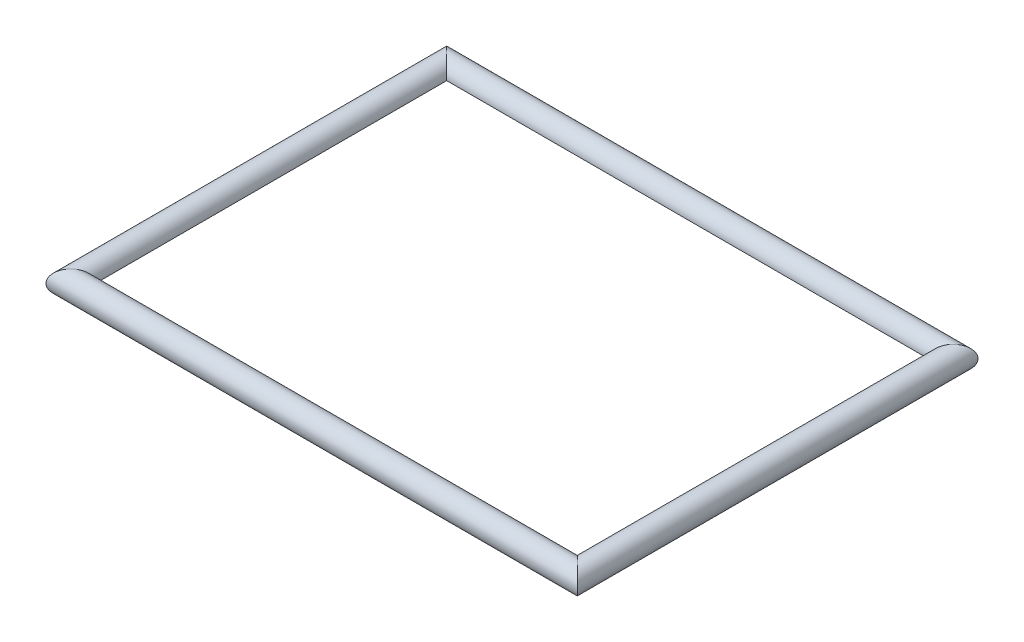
ISO-10303-21;
HEADER;
FILE_DESCRIPTION(('STEP AP214'),'2;1');
FILE_NAME('part.step','',(''),(''),'','','');
FILE_SCHEMA(('AUTOMOTIVE_DESIGN { 1 0 10303 214 1 1 1 1 }'));
ENDSEC;
DATA;
#1=APPLICATION_CONTEXT('core data for automotive mechanical design processes');
#2=APPLICATION_PROTOCOL_DEFINITION('international standard','automotive_design',2000,#1);
#3=PRODUCT_CONTEXT('',#1,'mechanical');
#4=PRODUCT('Part','Part','',(#3));
#5=PRODUCT_RELATED_PRODUCT_CATEGORY('part','',(#4));
#6=PRODUCT_DEFINITION_FORMATION('','',#4);
#7=PRODUCT_DEFINITION_CONTEXT('part definition',#1,'design');
#8=PRODUCT_DEFINITION('design','',#6,#7);
#9=PRODUCT_DEFINITION_SHAPE('','',#8);
#10=(LENGTH_UNIT() NAMED_UNIT(*) SI_UNIT(.MILLI.,.METRE.));
#11=(NAMED_UNIT(*) PLANE_ANGLE_UNIT() SI_UNIT($,.RADIAN.));
#12=(NAMED_UNIT(*) SI_UNIT($,.STERADIAN.) SOLID_ANGLE_UNIT());
#13=UNCERTAINTY_MEASURE_WITH_UNIT(LENGTH_MEASURE(1.E-05),#10,'distance_accuracy_value','');
#14=(GEOMETRIC_REPRESENTATION_CONTEXT(3) GLOBAL_UNCERTAINTY_ASSIGNED_CONTEXT((#13)) GLOBAL_UNIT_ASSIGNED_CONTEXT((#10,
#11,#12)) REPRESENTATION_CONTEXT('',''));
#15=CARTESIAN_POINT('',(0.,0.,0.));
#16=DIRECTION('',(0.,0.,1.));
#17=DIRECTION('',(1.,0.,0.));
#18=AXIS2_PLACEMENT_3D('',#15,#16,#17);
#19=CARTESIAN_POINT('',(107.4,0.,-75.55));
#20=DIRECTION('',(-1.,0.,0.));
#21=DIRECTION('',(0.,0.,1.));
#22=AXIS2_PLACEMENT_3D('',#19,#20,#21);
#23=CYLINDRICAL_SURFACE('',#22,5.);
#24=DIRECTION('',(-1.,0.,0.));
#25=VECTOR('',#24,1.);
#26=CARTESIAN_POINT('',(107.4,-5.,-75.55));
#27=LINE('',#26,#25);
#28=CARTESIAN_POINT('',(101.8,-5.,-75.55));
#29=VERTEX_POINT('',#28);
#30=CARTESIAN_POINT('',(-101.8,-5.,-75.55));
#31=VERTEX_POINT('',#30);
#32=EDGE_CURVE('E138',#29,#31,#27,.T.);
#33=ORIENTED_EDGE('',*,*,#32,.T.);
#34=CARTESIAN_POINT('',(-101.8,0.,-75.5500000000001));
#35=DIRECTION('',(-0.707106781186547,0.,0.707106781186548));
#36=DIRECTION('',(0.707106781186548,0.,0.707106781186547));
#37=AXIS2_PLACEMENT_3D('',#34,#35,#36);
#38=ELLIPSE('',#37,7.07106781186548,5.);
#39=CARTESIAN_POINT('',(-96.8,0.,-70.55));
#40=VERTEX_POINT('',#39);
#41=EDGE_CURVE('E60',#31,#40,#38,.F.);
#42=ORIENTED_EDGE('',*,*,#41,.T.);
#43=DIRECTION('',(-1.,0.,0.));
#44=VECTOR('',#43,1.);
#45=CARTESIAN_POINT('',(107.4,0.,-70.55));
#46=LINE('',#45,#44);
#47=CARTESIAN_POINT('',(96.8,0.,-70.55));
#48=VERTEX_POINT('',#47);
#49=EDGE_CURVE('E148',#40,#48,#46,.F.);
#50=ORIENTED_EDGE('',*,*,#49,.T.);
#51=CARTESIAN_POINT('',(101.8,0.,-75.55));
#52=DIRECTION('',(-0.707106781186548,0.,-0.707106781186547));
#53=DIRECTION('',(0.707106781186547,0.,-0.707106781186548));
#54=AXIS2_PLACEMENT_3D('',#51,#52,#53);
#55=ELLIPSE('',#54,7.07106781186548,5.);
#56=EDGE_CURVE('E143',#29,#48,#55,.F.);
#57=ORIENTED_EDGE('',*,*,#56,.F.);
#58=EDGE_LOOP('',(#33,#42,#50,#57));
#59=FACE_BOUND('',#58,.T.);
#60=ADVANCED_FACE('F57',(#59),#23,.T.);
#61=CARTESIAN_POINT('',(-101.8,0.,-81.1500000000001));
#62=DIRECTION('',(0.,0.,1.));
#63=DIRECTION('',(1.,0.,0.));
#64=AXIS2_PLACEMENT_3D('',#61,#62,#63);
#65=CYLINDRICAL_SURFACE('',#64,5.);
#66=DIRECTION('',(0.,0.,1.));
#67=VECTOR('',#66,1.);
#68=CARTESIAN_POINT('',(-101.8,-5.,-81.1500000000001));
#69=LINE('',#68,#67);
#70=CARTESIAN_POINT('',(-101.8,-5.,75.5500000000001));
#71=VERTEX_POINT('',#70);
#72=EDGE_CURVE('E124',#31,#71,#69,.T.);
#73=ORIENTED_EDGE('',*,*,#72,.T.);
#74=CARTESIAN_POINT('',(-101.8,0.,75.55));
#75=DIRECTION('',(0.707106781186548,0.,0.707106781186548));
#76=DIRECTION('',(0.707106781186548,0.,-0.707106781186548));
#77=AXIS2_PLACEMENT_3D('',#74,#75,#76);
#78=ELLIPSE('',#77,7.07106781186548,5.);
#79=CARTESIAN_POINT('',(-96.7999999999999,0.,70.55));
#80=VERTEX_POINT('',#79);
#81=EDGE_CURVE('E66',#71,#80,#78,.F.);
#82=ORIENTED_EDGE('',*,*,#81,.T.);
#83=DIRECTION('',(0.,0.,1.));
#84=VECTOR('',#83,1.);
#85=CARTESIAN_POINT('',(-96.8,0.,-81.1500000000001));
#86=LINE('',#85,#84);
#87=EDGE_CURVE('E82',#80,#40,#86,.F.);
#88=ORIENTED_EDGE('',*,*,#87,.T.);
#89=ORIENTED_EDGE('',*,*,#41,.F.);
#90=EDGE_LOOP('',(#73,#82,#88,#89));
#91=FACE_BOUND('',#90,.T.);
#92=ADVANCED_FACE('F135',(#91),#65,.T.);
#93=CARTESIAN_POINT('',(101.8,0.,81.15));
#94=DIRECTION('',(0.,0.,-1.));
#95=DIRECTION('',(-1.,0.,0.));
#96=AXIS2_PLACEMENT_3D('',#93,#94,#95);
#97=CYLINDRICAL_SURFACE('',#96,5.);
#98=DIRECTION('',(0.,0.,-1.));
#99=VECTOR('',#98,1.);
#100=CARTESIAN_POINT('',(101.8,-5.,81.15));
#101=LINE('',#100,#99);
#102=CARTESIAN_POINT('',(101.8,-5.,75.55));
#103=VERTEX_POINT('',#102);
#104=EDGE_CURVE('E119',#103,#29,#101,.T.);
#105=ORIENTED_EDGE('',*,*,#104,.T.);
#106=ORIENTED_EDGE('',*,*,#56,.T.);
#107=DIRECTION('',(0.,0.,-1.));
#108=VECTOR('',#107,1.);
#109=CARTESIAN_POINT('',(96.8000000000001,0.,81.15));
#110=LINE('',#109,#108);
#111=CARTESIAN_POINT('',(96.8,0.,70.55));
#112=VERTEX_POINT('',#111);
#113=EDGE_CURVE('E154',#48,#112,#110,.F.);
#114=ORIENTED_EDGE('',*,*,#113,.T.);
#115=CARTESIAN_POINT('',(101.8,0.,75.55));
#116=DIRECTION('',(0.707106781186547,0.,-0.707106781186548));
#117=DIRECTION('',(0.707106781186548,0.,0.707106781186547));
#118=AXIS2_PLACEMENT_3D('',#115,#116,#117);
#119=ELLIPSE('',#118,7.07106781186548,5.);
#120=EDGE_CURVE('E12',#103,#112,#119,.F.);
#121=ORIENTED_EDGE('',*,*,#120,.F.);
#122=EDGE_LOOP('',(#105,#106,#114,#121));
#123=FACE_BOUND('',#122,.T.);
#124=ADVANCED_FACE('F187',(#123),#97,.T.);
#125=CARTESIAN_POINT('',(-107.4,0.,75.55));
#126=DIRECTION('',(1.,0.,0.));
#127=DIRECTION('',(0.,0.,-1.));
#128=AXIS2_PLACEMENT_3D('',#125,#126,#127);
#129=CYLINDRICAL_SURFACE('',#128,5.);
#130=DIRECTION('',(1.,0.,0.));
#131=VECTOR('',#130,1.);
#132=CARTESIAN_POINT('',(-107.4,-5.,75.55));
#133=LINE('',#132,#131);
#134=EDGE_CURVE('E110',#71,#103,#133,.T.);
#135=ORIENTED_EDGE('',*,*,#134,.T.);
#136=ORIENTED_EDGE('',*,*,#120,.T.);
#137=DIRECTION('',(1.,0.,0.));
#138=VECTOR('',#137,1.);
#139=CARTESIAN_POINT('',(-107.4,0.,70.55));
#140=LINE('',#139,#138);
#141=EDGE_CURVE('E141',#112,#80,#140,.F.);
#142=ORIENTED_EDGE('',*,*,#141,.T.);
#143=ORIENTED_EDGE('',*,*,#81,.F.);
#144=EDGE_LOOP('',(#135,#136,#142,#143));
#145=FACE_BOUND('',#144,.T.);
#146=ADVANCED_FACE('F140',(#145),#129,.T.);
#147=CARTESIAN_POINT('',(101.8,-5.001,-75.55));
#148=DIRECTION('',(1.,0.,0.));
#149=DIRECTION('',(0.,0.,-1.));
#150=AXIS2_PLACEMENT_3D('',#147,#148,#149);
#151=PLANE('',#150);
#152=DIRECTION('',(0.,1.,0.));
#153=VECTOR('',#152,1.);
#154=CARTESIAN_POINT('',(101.8,-5.001,75.55));
#155=LINE('',#154,#153);
#156=CARTESIAN_POINT('',(101.8,0.,75.55));
#157=VERTEX_POINT('',#156);
#158=EDGE_CURVE('E74',#103,#157,#155,.T.);
#159=ORIENTED_EDGE('',*,*,#158,.T.);
#160=DIRECTION('',(0.,0.,-1.));
#161=VECTOR('',#160,1.);
#162=CARTESIAN_POINT('',(101.8,0.,-75.55));
#163=LINE('',#162,#161);
#164=CARTESIAN_POINT('',(101.8,0.,-75.55));
#165=VERTEX_POINT('',#164);
#166=EDGE_CURVE('E176',#157,#165,#163,.T.);
#167=ORIENTED_EDGE('',*,*,#166,.T.);
#168=DIRECTION('',(0.,1.,0.));
#169=VECTOR('',#168,1.);
#170=CARTESIAN_POINT('',(101.8,-5.001,-75.55));
#171=LINE('',#170,#169);
#172=EDGE_CURVE('E160',#29,#165,#171,.T.);
#173=ORIENTED_EDGE('',*,*,#172,.F.);
#174=ORIENTED_EDGE('',*,*,#104,.F.);
#175=EDGE_LOOP('',(#159,#167,#173,#174));
#176=FACE_BOUND('',#175,.T.);
#177=ADVANCED_FACE('F197',(#176),#151,.F.);
#178=CARTESIAN_POINT('',(-101.8,-5.001,-75.55));
#179=DIRECTION('',(-1.,0.,0.));
#180=DIRECTION('',(0.,0.,1.));
#181=AXIS2_PLACEMENT_3D('',#178,#179,#180);
#182=PLANE('',#181);
#183=DIRECTION('',(0.,1.,0.));
#184=VECTOR('',#183,1.);
#185=CARTESIAN_POINT('',(-101.8,-5.001,-75.55));
#186=LINE('',#185,#184);
#187=CARTESIAN_POINT('',(-101.8,0.,-75.55));
#188=VERTEX_POINT('',#187);
#189=EDGE_CURVE('E130',#31,#188,#186,.T.);
#190=ORIENTED_EDGE('',*,*,#189,.T.);
#191=DIRECTION('',(0.,0.,1.));
#192=VECTOR('',#191,1.);
#193=CARTESIAN_POINT('',(-101.8,0.,-75.55));
#194=LINE('',#193,#192);
#195=CARTESIAN_POINT('',(-101.8,0.,75.55));
#196=VERTEX_POINT('',#195);
#197=EDGE_CURVE('E127',#188,#196,#194,.T.);
#198=ORIENTED_EDGE('',*,*,#197,.T.);
#199=DIRECTION('',(0.,1.,0.));
#200=VECTOR('',#199,1.);
#201=CARTESIAN_POINT('',(-101.8,-5.001,75.55));
#202=LINE('',#201,#200);
#203=EDGE_CURVE('E113',#71,#196,#202,.T.);
#204=ORIENTED_EDGE('',*,*,#203,.F.);
#205=ORIENTED_EDGE('',*,*,#72,.F.);
#206=EDGE_LOOP('',(#190,#198,#204,#205));
#207=FACE_BOUND('',#206,.T.);
#208=ADVANCED_FACE('F123',(#207),#182,.F.);
#209=CARTESIAN_POINT('',(-101.8,-5.001,-75.55));
#210=DIRECTION('',(0.,0.,-1.));
#211=DIRECTION('',(-1.,0.,0.));
#212=AXIS2_PLACEMENT_3D('',#209,#210,#211);
#213=PLANE('',#212);
#214=ORIENTED_EDGE('',*,*,#172,.T.);
#215=DIRECTION('',(-1.,0.,0.));
#216=VECTOR('',#215,1.);
#217=CARTESIAN_POINT('',(-101.8,0.,-75.55));
#218=LINE('',#217,#216);
#219=EDGE_CURVE('E172',#165,#188,#218,.T.);
#220=ORIENTED_EDGE('',*,*,#219,.T.);
#221=ORIENTED_EDGE('',*,*,#189,.F.);
#222=ORIENTED_EDGE('',*,*,#32,.F.);
#223=EDGE_LOOP('',(#214,#220,#221,#222));
#224=FACE_BOUND('',#223,.T.);
#225=ADVANCED_FACE('F199',(#224),#213,.F.);
#226=CARTESIAN_POINT('',(-101.8,-5.001,75.55));
#227=DIRECTION('',(0.,0.,1.));
#228=DIRECTION('',(1.,0.,0.));
#229=AXIS2_PLACEMENT_3D('',#226,#227,#228);
#230=PLANE('',#229);
#231=ORIENTED_EDGE('',*,*,#203,.T.);
#232=DIRECTION('',(1.,0.,0.));
#233=VECTOR('',#232,1.);
#234=CARTESIAN_POINT('',(-101.8,0.,75.55));
#235=LINE('',#234,#233);
#236=EDGE_CURVE('E163',#196,#157,#235,.T.);
#237=ORIENTED_EDGE('',*,*,#236,.T.);
#238=ORIENTED_EDGE('',*,*,#158,.F.);
#239=ORIENTED_EDGE('',*,*,#134,.F.);
#240=EDGE_LOOP('',(#231,#237,#238,#239));
#241=FACE_BOUND('',#240,.T.);
#242=ADVANCED_FACE('F112',(#241),#230,.F.);
#243=CARTESIAN_POINT('',(0.,0.,0.));
#244=DIRECTION('',(0.,1.,0.));
#245=DIRECTION('',(0.,0.,1.));
#246=AXIS2_PLACEMENT_3D('',#243,#244,#245);
#247=PLANE('',#246);
#248=ORIENTED_EDGE('',*,*,#87,.F.);
#249=ORIENTED_EDGE('',*,*,#141,.F.);
#250=ORIENTED_EDGE('',*,*,#113,.F.);
#251=ORIENTED_EDGE('',*,*,#49,.F.);
#252=EDGE_LOOP('',(#248,#249,#250,#251));
#253=FACE_BOUND('',#252,.T.);
#254=ORIENTED_EDGE('',*,*,#166,.F.);
#255=ORIENTED_EDGE('',*,*,#236,.F.);
#256=ORIENTED_EDGE('',*,*,#197,.F.);
#257=ORIENTED_EDGE('',*,*,#219,.F.);
#258=EDGE_LOOP('',(#254,#255,#256,#257));
#259=FACE_BOUND('',#258,.T.);
#260=ADVANCED_FACE('F191',(#253,#259),#247,.F.);
#261=CLOSED_SHELL('',(#60,#92,#124,#146,#177,#208,#225,#242,#260));
#262=MANIFOLD_SOLID_BREP('B2',#261);
#263=ADVANCED_BREP_SHAPE_REPRESENTATION('',(#18,#262),#14);
#264=SHAPE_DEFINITION_REPRESENTATION(#9,#263);
ENDSEC;
END-ISO-10303-21;
